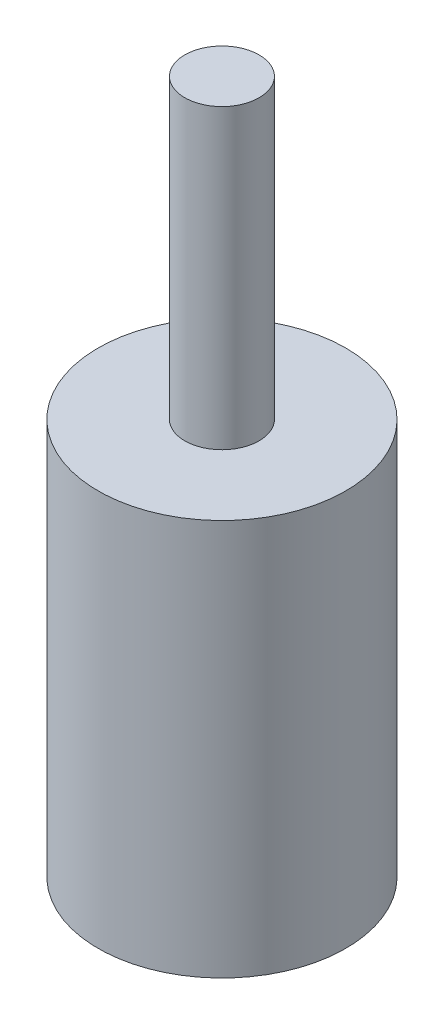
ISO-10303-21;
HEADER;
FILE_DESCRIPTION(('STEP AP214'),'2;1');
FILE_NAME('part.step','',(''),(''),'','','');
FILE_SCHEMA(('AUTOMOTIVE_DESIGN { 1 0 10303 214 1 1 1 1 }'));
ENDSEC;
DATA;
#1=APPLICATION_CONTEXT('core data for automotive mechanical design processes');
#2=APPLICATION_PROTOCOL_DEFINITION('international standard','automotive_design',2000,#1);
#3=PRODUCT_CONTEXT('',#1,'mechanical');
#4=PRODUCT('Part','Part','',(#3));
#5=PRODUCT_RELATED_PRODUCT_CATEGORY('part','',(#4));
#6=PRODUCT_DEFINITION_FORMATION('','',#4);
#7=PRODUCT_DEFINITION_CONTEXT('part definition',#1,'design');
#8=PRODUCT_DEFINITION('design','',#6,#7);
#9=PRODUCT_DEFINITION_SHAPE('','',#8);
#10=(LENGTH_UNIT() NAMED_UNIT(*) SI_UNIT(.MILLI.,.METRE.));
#11=(NAMED_UNIT(*) PLANE_ANGLE_UNIT() SI_UNIT($,.RADIAN.));
#12=(NAMED_UNIT(*) SI_UNIT($,.STERADIAN.) SOLID_ANGLE_UNIT());
#13=UNCERTAINTY_MEASURE_WITH_UNIT(LENGTH_MEASURE(1.E-05),#10,'distance_accuracy_value','');
#14=(GEOMETRIC_REPRESENTATION_CONTEXT(3) GLOBAL_UNCERTAINTY_ASSIGNED_CONTEXT((#13)) GLOBAL_UNIT_ASSIGNED_CONTEXT((#10,
#11,#12)) REPRESENTATION_CONTEXT('',''));
#15=CARTESIAN_POINT('',(0.,0.,0.));
#16=DIRECTION('',(0.,0.,1.));
#17=DIRECTION('',(1.,0.,0.));
#18=AXIS2_PLACEMENT_3D('',#15,#16,#17);
#19=CARTESIAN_POINT('',(0.,15.24,0.));
#20=DIRECTION('',(0.,-1.,0.));
#21=DIRECTION('',(0.,0.,-1.));
#22=AXIS2_PLACEMENT_3D('',#19,#20,#21);
#23=CYLINDRICAL_SURFACE('',#22,1.905);
#24=CARTESIAN_POINT('',(0.,15.24,0.));
#25=DIRECTION('',(0.,1.,0.));
#26=DIRECTION('',(0.,0.,1.));
#27=AXIS2_PLACEMENT_3D('',#24,#25,#26);
#28=CIRCLE('',#27,1.905);
#29=CARTESIAN_POINT('',(0.,15.24,-1.905));
#30=VERTEX_POINT('',#29);
#31=EDGE_CURVE('E11',#30,#30,#28,.T.);
#32=CARTESIAN_POINT('',(0.,0.,0.));
#33=DIRECTION('',(0.,1.,0.));
#34=DIRECTION('',(0.,0.,1.));
#35=AXIS2_PLACEMENT_3D('',#32,#33,#34);
#36=CIRCLE('',#35,1.905);
#37=CARTESIAN_POINT('',(0.,0.,-1.905));
#38=VERTEX_POINT('',#37);
#39=EDGE_CURVE('E48',#38,#38,#36,.T.);
#40=CARTESIAN_POINT('',(0.,15.24,-1.905));
#41=CARTESIAN_POINT('',(0.,15.08125,-1.905));
#42=CARTESIAN_POINT('',(0.,14.9225,-1.905));
#43=CARTESIAN_POINT('',(0.,14.605,-1.905));
#44=CARTESIAN_POINT('',(0.,14.44625,-1.905));
#45=CARTESIAN_POINT('',(0.,14.12875,-1.905));
#46=CARTESIAN_POINT('',(0.,13.97,-1.905));
#47=CARTESIAN_POINT('',(0.,13.6525,-1.905));
#48=CARTESIAN_POINT('',(0.,13.49375,-1.905));
#49=CARTESIAN_POINT('',(0.,13.17625,-1.905));
#50=CARTESIAN_POINT('',(0.,13.0175,-1.905));
#51=CARTESIAN_POINT('',(0.,12.7,-1.905));
#52=CARTESIAN_POINT('',(0.,12.54125,-1.905));
#53=CARTESIAN_POINT('',(0.,12.22375,-1.905));
#54=CARTESIAN_POINT('',(0.,12.065,-1.905));
#55=CARTESIAN_POINT('',(0.,11.7475,-1.905));
#56=CARTESIAN_POINT('',(0.,11.58875,-1.905));
#57=CARTESIAN_POINT('',(0.,11.27125,-1.905));
#58=CARTESIAN_POINT('',(0.,11.1125,-1.905));
#59=CARTESIAN_POINT('',(0.,10.795,-1.905));
#60=CARTESIAN_POINT('',(0.,10.63625,-1.905));
#61=CARTESIAN_POINT('',(0.,10.31875,-1.905));
#62=CARTESIAN_POINT('',(0.,10.16,-1.905));
#63=CARTESIAN_POINT('',(0.,9.8425,-1.905));
#64=CARTESIAN_POINT('',(0.,9.68375,-1.905));
#65=CARTESIAN_POINT('',(0.,9.36625,-1.905));
#66=CARTESIAN_POINT('',(0.,9.2075,-1.905));
#67=CARTESIAN_POINT('',(0.,8.89,-1.905));
#68=CARTESIAN_POINT('',(0.,8.73125,-1.905));
#69=CARTESIAN_POINT('',(0.,8.41375,-1.905));
#70=CARTESIAN_POINT('',(0.,8.255,-1.905));
#71=CARTESIAN_POINT('',(0.,7.9375,-1.905));
#72=CARTESIAN_POINT('',(0.,7.77875,-1.905));
#73=CARTESIAN_POINT('',(0.,7.46125,-1.905));
#74=CARTESIAN_POINT('',(0.,7.3025,-1.905));
#75=CARTESIAN_POINT('',(0.,6.985,-1.905));
#76=CARTESIAN_POINT('',(0.,6.82625,-1.905));
#77=CARTESIAN_POINT('',(0.,6.50875,-1.905));
#78=CARTESIAN_POINT('',(0.,6.35,-1.905));
#79=CARTESIAN_POINT('',(0.,6.0325,-1.905));
#80=CARTESIAN_POINT('',(0.,5.87375,-1.905));
#81=CARTESIAN_POINT('',(0.,5.55625,-1.905));
#82=CARTESIAN_POINT('',(0.,5.3975,-1.905));
#83=CARTESIAN_POINT('',(0.,5.08,-1.905));
#84=CARTESIAN_POINT('',(0.,4.92125,-1.905));
#85=CARTESIAN_POINT('',(0.,4.60375,-1.905));
#86=CARTESIAN_POINT('',(0.,4.445,-1.905));
#87=CARTESIAN_POINT('',(0.,4.1275,-1.905));
#88=CARTESIAN_POINT('',(0.,3.96875,-1.905));
#89=CARTESIAN_POINT('',(0.,3.65125,-1.905));
#90=CARTESIAN_POINT('',(0.,3.4925,-1.905));
#91=CARTESIAN_POINT('',(0.,3.175,-1.905));
#92=CARTESIAN_POINT('',(0.,3.01625,-1.905));
#93=CARTESIAN_POINT('',(0.,2.69875,-1.905));
#94=CARTESIAN_POINT('',(0.,2.54,-1.905));
#95=CARTESIAN_POINT('',(0.,2.2225,-1.905));
#96=CARTESIAN_POINT('',(0.,2.06375,-1.905));
#97=CARTESIAN_POINT('',(0.,1.74625,-1.905));
#98=CARTESIAN_POINT('',(0.,1.5875,-1.905));
#99=CARTESIAN_POINT('',(0.,1.27,-1.905));
#100=CARTESIAN_POINT('',(0.,1.11125,-1.905));
#101=CARTESIAN_POINT('',(0.,0.79375,-1.905));
#102=CARTESIAN_POINT('',(0.,0.634999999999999,-1.905));
#103=CARTESIAN_POINT('',(0.,0.3175,-1.905));
#104=CARTESIAN_POINT('',(0.,0.15875,-1.905));
#105=CARTESIAN_POINT('',(0.,0.,-1.905));
#106=B_SPLINE_CURVE_WITH_KNOTS('',3,(#40,#41,#42,#43,#44,#45,#46,#47,#48,#49,#50,#51,#52,#53,
#54,#55,#56,#57,#58,#59,#60,#61,#62,#63,#64,#65,#66,#67,#68,#69,#70,#71,#72,#73,#74,#75,#76,#77,
#78,#79,#80,#81,#82,#83,#84,#85,#86,#87,#88,#89,#90,#91,#92,#93,#94,#95,#96,#97,#98,#99,#100,
#101,#102,#103,#104,#105),.UNSPECIFIED.,.F.,.F.,(4,2,2,2,2,2,2,2,2,2,2,2,2,2,2,2,2,2,2,2,2,2,2,
2,2,2,2,2,2,2,2,2,4),(0.,0.476250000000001,0.9525,1.42875,1.905,2.38125,2.8575,3.33375,3.81,
4.28625,4.7625,5.23875,5.715,6.19125,6.6675,7.14375,7.62,8.09625,8.5725,9.04875,9.525,10.00125,
10.4775,10.95375,11.43,11.90625,12.3825,12.85875,13.335,13.81125,14.2875,14.76375,15.24),.UNSPECIFIED.);
#107=EDGE_CURVE('BSEAM45',#30,#38,#106,.T.);
#108=ORIENTED_EDGE('',*,*,#31,.F.);
#109=ORIENTED_EDGE('',*,*,#39,.T.);
#110=ORIENTED_EDGE('',*,*,#107,.T.);
#111=ORIENTED_EDGE('',*,*,#107,.F.);
#112=EDGE_LOOP('',(#108,#110,#109,#111));
#113=FACE_BOUND('',#112,.T.);
#114=ADVANCED_FACE('F45',(#113),#23,.T.);
#115=CARTESIAN_POINT('',(0.,15.24,0.));
#116=DIRECTION('',(0.,1.,0.));
#117=DIRECTION('',(0.,0.,1.));
#118=AXIS2_PLACEMENT_3D('',#115,#116,#117);
#119=PLANE('',#118);
#120=ORIENTED_EDGE('',*,*,#31,.T.);
#121=EDGE_LOOP('',(#120));
#122=FACE_BOUND('',#121,.T.);
#123=ADVANCED_FACE('F120',(#122),#119,.T.);
#124=CARTESIAN_POINT('',(0.,-20.32,0.));
#125=DIRECTION('',(0.,1.,0.));
#126=DIRECTION('',(0.,0.,1.));
#127=AXIS2_PLACEMENT_3D('',#124,#125,#126);
#128=CYLINDRICAL_SURFACE('',#127,6.35);
#129=CARTESIAN_POINT('',(0.,-20.32,0.));
#130=DIRECTION('',(0.,-1.,0.));
#131=DIRECTION('',(0.,0.,-1.));
#132=AXIS2_PLACEMENT_3D('',#129,#130,#131);
#133=CIRCLE('',#132,6.35);
#134=CARTESIAN_POINT('',(0.,-20.32,-6.35));
#135=VERTEX_POINT('',#134);
#136=EDGE_CURVE('E96',#135,#135,#133,.T.);
#137=ORIENTED_EDGE('',*,*,#136,.F.);
#138=EDGE_LOOP('',(#137));
#139=FACE_BOUND('',#138,.T.);
#140=CARTESIAN_POINT('',(0.,0.,0.));
#141=DIRECTION('',(0.,-1.,0.));
#142=DIRECTION('',(0.,0.,-1.));
#143=AXIS2_PLACEMENT_3D('',#140,#141,#142);
#144=CIRCLE('',#143,6.35);
#145=CARTESIAN_POINT('',(0.,0.,-6.35));
#146=VERTEX_POINT('',#145);
#147=EDGE_CURVE('E77',#146,#146,#144,.T.);
#148=ORIENTED_EDGE('',*,*,#147,.T.);
#149=EDGE_LOOP('',(#148));
#150=FACE_BOUND('',#149,.T.);
#151=ADVANCED_FACE('F104',(#139,#150),#128,.T.);
#152=CARTESIAN_POINT('',(0.,-20.32,0.));
#153=DIRECTION('',(0.,-1.,0.));
#154=DIRECTION('',(0.,0.,-1.));
#155=AXIS2_PLACEMENT_3D('',#152,#153,#154);
#156=PLANE('',#155);
#157=CARTESIAN_POINT('',(0.,-20.32,0.));
#158=DIRECTION('',(0.,-1.,0.));
#159=DIRECTION('',(0.,0.,-1.));
#160=AXIS2_PLACEMENT_3D('',#157,#158,#159);
#161=CIRCLE('',#160,3.556);
#162=CARTESIAN_POINT('',(-2.36594473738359,-20.32,2.65470177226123));
#163=VERTEX_POINT('',#162);
#164=CARTESIAN_POINT('',(1.14130547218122,-20.32,3.36787140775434));
#165=VERTEX_POINT('',#164);
#166=EDGE_CURVE('E60',#163,#165,#161,.T.);
#167=ORIENTED_EDGE('',*,*,#166,.F.);
#168=DIRECTION('',(-0.979945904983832,0.,-0.19926370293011));
#169=VECTOR('',#168,1.);
#170=CARTESIAN_POINT('',(-2.36594473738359,-20.32,2.65470177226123));
#171=LINE('',#170,#169);
#172=EDGE_CURVE('E81',#165,#163,#171,.T.);
#173=ORIENTED_EDGE('',*,*,#172,.F.);
#174=EDGE_LOOP('',(#167,#173));
#175=FACE_BOUND('',#174,.T.);
#176=ORIENTED_EDGE('',*,*,#136,.T.);
#177=EDGE_LOOP('',(#176));
#178=FACE_BOUND('',#177,.T.);
#179=ADVANCED_FACE('F86',(#175,#178),#156,.T.);
#180=CARTESIAN_POINT('',(0.,0.,0.));
#181=DIRECTION('',(0.,-1.,0.));
#182=DIRECTION('',(0.,0.,-1.));
#183=AXIS2_PLACEMENT_3D('',#180,#181,#182);
#184=PLANE('',#183);
#185=ORIENTED_EDGE('',*,*,#39,.F.);
#186=EDGE_LOOP('',(#185));
#187=FACE_BOUND('',#186,.T.);
#188=ORIENTED_EDGE('',*,*,#147,.F.);
#189=EDGE_LOOP('',(#188));
#190=FACE_BOUND('',#189,.T.);
#191=ADVANCED_FACE('F106',(#187,#190),#184,.F.);
#192=CARTESIAN_POINT('',(0.,-5.08,0.));
#193=DIRECTION('',(0.,-1.,0.));
#194=DIRECTION('',(0.,0.,-1.));
#195=AXIS2_PLACEMENT_3D('',#192,#193,#194);
#196=CYLINDRICAL_SURFACE('',#195,3.556);
#197=ORIENTED_EDGE('',*,*,#166,.T.);
#198=DIRECTION('',(0.,-1.,0.));
#199=VECTOR('',#198,1.);
#200=CARTESIAN_POINT('',(1.14130547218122,-5.08,3.36787140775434));
#201=LINE('',#200,#199);
#202=CARTESIAN_POINT('',(1.14130547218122,-5.08,3.36787140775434));
#203=VERTEX_POINT('',#202);
#204=EDGE_CURVE('E78',#203,#165,#201,.T.);
#205=ORIENTED_EDGE('',*,*,#204,.F.);
#206=CARTESIAN_POINT('',(0.,-5.08,0.));
#207=DIRECTION('',(0.,-1.,0.));
#208=DIRECTION('',(0.,0.,-1.));
#209=AXIS2_PLACEMENT_3D('',#206,#207,#208);
#210=CIRCLE('',#209,3.556);
#211=CARTESIAN_POINT('',(-2.36594473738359,-5.08,2.65470177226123));
#212=VERTEX_POINT('',#211);
#213=EDGE_CURVE('E74',#212,#203,#210,.T.);
#214=ORIENTED_EDGE('',*,*,#213,.F.);
#215=DIRECTION('',(0.,-1.,0.));
#216=VECTOR('',#215,1.);
#217=CARTESIAN_POINT('',(-2.36594473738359,-5.08,2.65470177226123));
#218=LINE('',#217,#216);
#219=EDGE_CURVE('E68',#212,#163,#218,.T.);
#220=ORIENTED_EDGE('',*,*,#219,.T.);
#221=EDGE_LOOP('',(#197,#205,#214,#220));
#222=FACE_BOUND('',#221,.T.);
#223=ADVANCED_FACE('F72',(#222),#196,.F.);
#224=CARTESIAN_POINT('',(-2.36594473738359,-5.08,2.65470177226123));
#225=DIRECTION('',(-0.19926370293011,0.,0.979945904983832));
#226=DIRECTION('',(0.979945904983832,0.,0.19926370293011));
#227=AXIS2_PLACEMENT_3D('',#224,#225,#226);
#228=PLANE('',#227);
#229=ORIENTED_EDGE('',*,*,#172,.T.);
#230=ORIENTED_EDGE('',*,*,#219,.F.);
#231=DIRECTION('',(-0.979945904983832,0.,-0.19926370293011));
#232=VECTOR('',#231,1.);
#233=CARTESIAN_POINT('',(-2.36594473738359,-5.08,2.65470177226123));
#234=LINE('',#233,#232);
#235=EDGE_CURVE('E91',#203,#212,#234,.T.);
#236=ORIENTED_EDGE('',*,*,#235,.F.);
#237=ORIENTED_EDGE('',*,*,#204,.T.);
#238=EDGE_LOOP('',(#229,#230,#236,#237));
#239=FACE_BOUND('',#238,.T.);
#240=ADVANCED_FACE('F82',(#239),#228,.F.);
#241=CARTESIAN_POINT('',(0.,-5.08,0.));
#242=DIRECTION('',(0.,-1.,0.));
#243=DIRECTION('',(0.,0.,-1.));
#244=AXIS2_PLACEMENT_3D('',#241,#242,#243);
#245=PLANE('',#244);
#246=ORIENTED_EDGE('',*,*,#213,.T.);
#247=ORIENTED_EDGE('',*,*,#235,.T.);
#248=EDGE_LOOP('',(#246,#247));
#249=FACE_BOUND('',#248,.T.);
#250=ADVANCED_FACE('F165',(#249),#245,.T.);
#251=CLOSED_SHELL('',(#114,#123,#151,#179,#191,#223,#240,#250));
#252=MANIFOLD_SOLID_BREP('B2',#251);
#253=ADVANCED_BREP_SHAPE_REPRESENTATION('',(#18,#252),#14);
#254=SHAPE_DEFINITION_REPRESENTATION(#9,#253);
ENDSEC;
END-ISO-10303-21;
